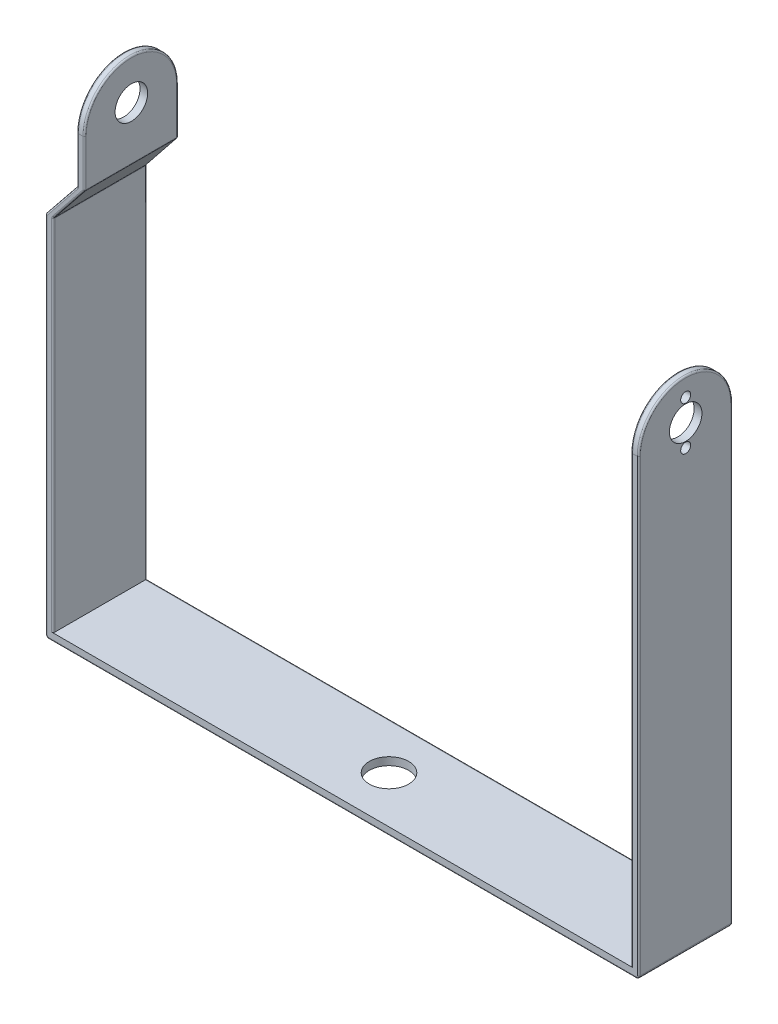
from build123d import *

# Parameters (mm, degrees)
EXTRUSION1_DEPTH        = 30
CONG_1_R                = 1
ESQUISSE2_W             = 10
ESQUISSE2_H             = 115
ENL_V_MAT_EXTRU_1_DEPTH = 30
ENL_V_MAT_EXTRU_2_DEPTH = 30
ESQUISSE4_R             = 5.21
ENL_V_MAT_EXTRU_3_DEPTH = 251.199920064
ENL_V_MAT_EXTRU_4_DEPTH = 251.199920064
CONG_3_R                = 0.5
ESQUISSE6_R             = 6.3
ENL_V_MAT_EXTRU_5_DEPTH = 251.199920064
ESQUISSE7_R             = 1.6
ENL_V_MAT_EXTRU_6_DEPTH = 10


with BuildPart() as part:
    # Esquisse1 → Extrusion1 (new body)
    with BuildSketch(Plane.XY):
        Polygon((-177.5, 2.5), (-177.5, 160), (-190, 160), (-190, 0), (0, 0), (0, 160), (-2.5, 160), (-2.5, 2.5), align=None)
    extrude(amount=EXTRUSION1_DEPTH)

    # Cong_1
    cong_1_edges = [part.edges().sort_by_distance(p)[0] for p in [
        (0, 0, 15),
        (-190, 0, 15),
    ]]
    fillet(cong_1_edges, radius=CONG_1_R)

    # Esquisse2 → Enl_v. mat.-Extru.1 (cut)
    with BuildSketch(Plane.XY.offset(30)):
        with Locations((-182.5, 60)):
            Rectangle(ESQUISSE2_W, ESQUISSE2_H)
    extrude(amount=-ENL_V_MAT_EXTRU_1_DEPTH, mode=Mode.SUBTRACT)

    # Esquisse3 → Enl_v. mat.-Extru.2 (cut)
    with BuildSketch(Plane.XY.offset(30)):
        Polygon((-179.93840728, 130), (-179.93840728, 160), (-190, 160), (-190, 117.5), align=None)
        Polygon((-177.5, 130), (-187.5, 117.5), (-177.5, 117.5), align=None)
    extrude(amount=-ENL_V_MAT_EXTRU_2_DEPTH, mode=Mode.SUBTRACT)

    # Esquisse4 → Enl_v. mat.-Extru.3 (cut, through all)
    with BuildSketch(Plane(origin=(0, 0, 0), x_dir=(0, 0, -1), z_dir=(1, 0, 0))):
        with Locations(Location((-15, 147.1, 0), (0, 0, 90))):
            Circle(ESQUISSE4_R)
    extrude(amount=-ENL_V_MAT_EXTRU_3_DEPTH, mode=Mode.SUBTRACT)

    # Esquisse5 → Enl_v. mat.-Extru.4 (cut, through all)
    with BuildSketch(Plane(origin=(0, 0, 0), x_dir=(0, 0, -1), z_dir=(1, 0, 0))):
        with BuildLine():
            Line((-30, 160), (-30, 145))
            ThreePointArc((-30, 145), (-25.606601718, 155.606601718), (-15, 160))
            Line((-15, 160), (-30, 160))
        make_face()
        with BuildLine():
            ThreePointArc((-15, 160), (-4.393398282, 155.606601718), (0, 145))
            Line((0, 145), (0, 160))
            Line((0, 160), (-15, 160))
        make_face()
    extrude(amount=-ENL_V_MAT_EXTRU_4_DEPTH, mode=Mode.SUBTRACT)

    # Cong_3
    cong_3_edges = [part.edges().sort_by_distance(p)[0] for p in [
        (0, 73, 0),
        (-95, 2.5, 0),
        (-177.5, 137.5, 0),
        (-2.5, 73.75, 0),
        (-95, 0, 0),
        (-95, 0, 30),
        (-0.292893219, 0.292893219, 0),
        (-189.707106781, 0.292893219, 0),
        (-0.292893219, 0.292893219, 30),
        (-189.707106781, 0.292893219, 30),
        (-187.5, 60, 0),
        (-187.5, 117.5, 15),
        (-187.5, 60, 30),
        (-2.5, 73.75, 30),
        (-190, 59.25, 0),
        (-190, 59.25, 30),
        (-184.96920364, 123.75, 0),
        (-179.93840728, 130, 15),
        (-190, 117.5, 15),
        (-179.93840728, 137.5, 0),
        (-184.96920364, 123.75, 30),
        (-179.93840728, 137.5, 30),
        (-182.5, 123.75, 30),
        (-177.5, 130, 15),
        (-182.5, 123.75, 0),
        (-179.93840728, 160, 15),
        (0, 73, 30),
        (-177.5, 137.5, 30),
        (-177.5, 160, 15),
        (-2.5, 160, 15),
        (0, 160, 15),
    ]]
    fillet(cong_3_edges, radius=CONG_3_R)

    # Esquisse6 → Enl_v. mat.-Extru.5 (cut, through all)
    with BuildSketch(Plane.XZ):
        with Locations(Location((-95, 15, 0), (0, 0, 270))):
            Circle(ESQUISSE6_R)
    extrude(amount=-ENL_V_MAT_EXTRU_5_DEPTH, mode=Mode.SUBTRACT)

    # Esquisse7 → Enl_v. mat.-Extru.6 (cut)
    with BuildSketch(Plane(origin=(0, 0, 0), x_dir=(0, 0, -1), z_dir=(1, 0, 0))):
        with Locations(Location((-15, 140.1, 0), (0, 0, 90))):
            Circle(ESQUISSE7_R)
        with Locations(Location((-15, 154.1, 0), (0, 0, 270))):
            Circle(ESQUISSE7_R)
    extrude(amount=-ENL_V_MAT_EXTRU_6_DEPTH, mode=Mode.SUBTRACT)


solid = part.part
